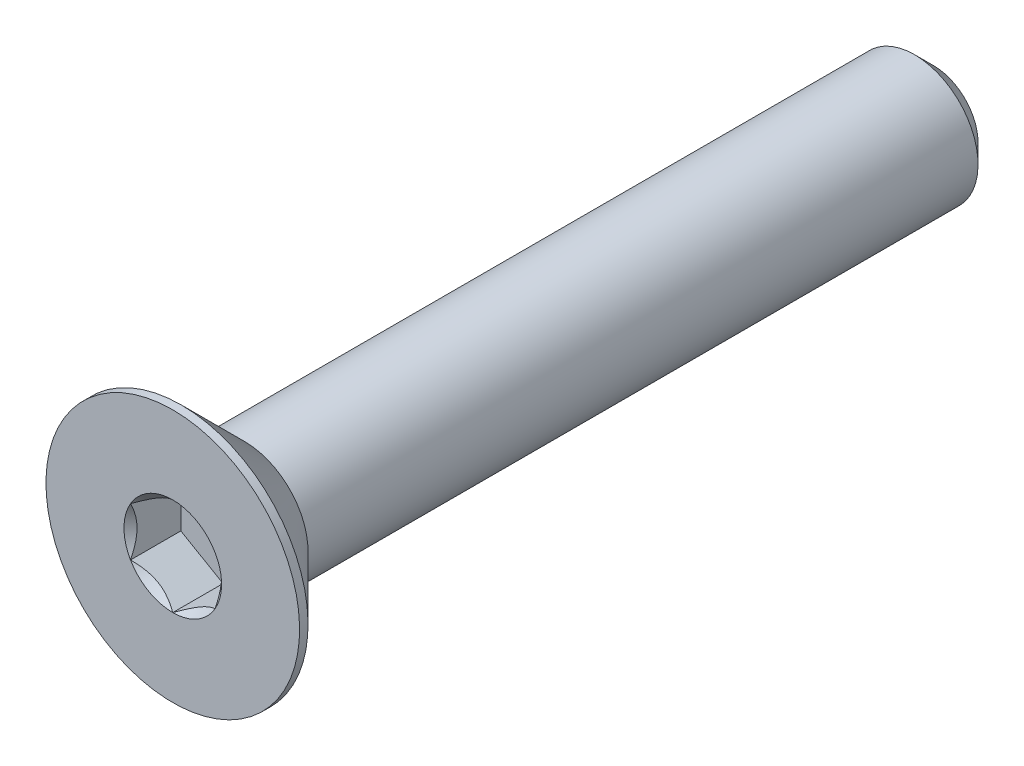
from build123d import *

# Parameters (mm, degrees)
SKETCH3_W          = 18
SKETCH3_H          = 1.5
CHAMFER1_SIZE      = 0.45
CUT_EXTRUDE1_DEPTH = 1.19


with BuildPart() as part:
    # Sketch3 → Revolve1 (revolve)
    with BuildSketch(Plane(origin=(0, 0, 0), x_dir=(0, 0, -1), z_dir=(1, 0, 0))):
        with Locations((0, 0.75)):
            Rectangle(SKETCH3_W, SKETCH3_H)
    revolve(axis=Axis((0, 0, -9), (0, 0, 1)))

    # Chamfer1
    chamfer1_edges = [part.edges().sort_by_distance(p)[0] for p in [
        (0, -1.5, -9),
    ]]
    chamfer(chamfer1_edges, length=CHAMFER1_SIZE)

    # Sketch6 → Revolve2 (revolve)
    with BuildSketch(Plane(origin=(0, 0, 0), x_dir=(0, 0, -1), z_dir=(1, 0, 0))):
        Polygon((-9, 3), (-8.8, 3), (-7.3, 1.5), (-7.3, 0), (-9, 0), align=None)
    revolve(axis=Axis((0, 0, -9), (0, 0, 1)))

    # Sketch8 → Cut-Extrude1 (cut)
    with BuildSketch(Plane.XY.offset(9)):
        Polygon((0, 1.154700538), (-1, 0.577350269), (-1, -0.577350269), (0, -1.154700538), (1, -0.577350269), (1, 0.577350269), align=None)
    extrude(amount=-CUT_EXTRUDE1_DEPTH, mode=Mode.SUBTRACT)

    # Cut-Extrude2 cone 1 section (on through the dimple's axis) → Cut-Extrude2 (revolve, cut)
    with BuildSketch(Plane(origin=(0, 0, 9), x_dir=(0, -1, 0), z_dir=(1, 0, 0))):
        Polygon((0, 0), (1.154700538, 0), (0, 1.154700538), align=None)
    revolve(axis=Axis((0, 0, 9), (0, 0, -1)), mode=Mode.SUBTRACT)


solid = part.part
